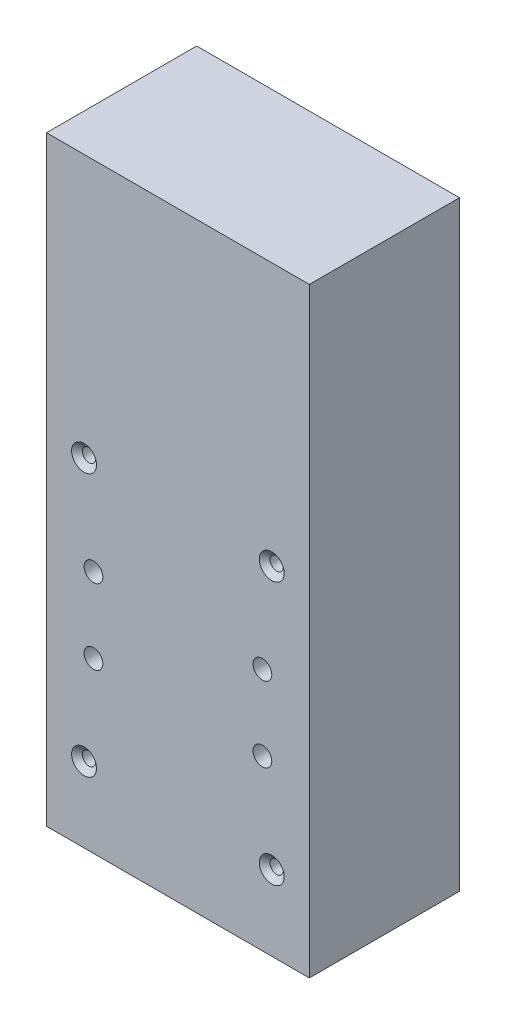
ISO-10303-21;
HEADER;
FILE_DESCRIPTION(('STEP AP214'),'2;1');
FILE_NAME('part.step','',(''),(''),'','','');
FILE_SCHEMA(('AUTOMOTIVE_DESIGN { 1 0 10303 214 1 1 1 1 }'));
ENDSEC;
DATA;
#1=APPLICATION_CONTEXT('core data for automotive mechanical design processes');
#2=APPLICATION_PROTOCOL_DEFINITION('international standard','automotive_design',2000,#1);
#3=PRODUCT_CONTEXT('',#1,'mechanical');
#4=PRODUCT('Part','Part','',(#3));
#5=PRODUCT_RELATED_PRODUCT_CATEGORY('part','',(#4));
#6=PRODUCT_DEFINITION_FORMATION('','',#4);
#7=PRODUCT_DEFINITION_CONTEXT('part definition',#1,'design');
#8=PRODUCT_DEFINITION('design','',#6,#7);
#9=PRODUCT_DEFINITION_SHAPE('','',#8);
#10=(LENGTH_UNIT() NAMED_UNIT(*) SI_UNIT(.MILLI.,.METRE.));
#11=(NAMED_UNIT(*) PLANE_ANGLE_UNIT() SI_UNIT($,.RADIAN.));
#12=(NAMED_UNIT(*) SI_UNIT($,.STERADIAN.) SOLID_ANGLE_UNIT());
#13=UNCERTAINTY_MEASURE_WITH_UNIT(LENGTH_MEASURE(1.E-05),#10,'distance_accuracy_value','');
#14=(GEOMETRIC_REPRESENTATION_CONTEXT(3) GLOBAL_UNCERTAINTY_ASSIGNED_CONTEXT((#13)) GLOBAL_UNIT_ASSIGNED_CONTEXT((#10,
#11,#12)) REPRESENTATION_CONTEXT('',''));
#15=CARTESIAN_POINT('',(0.,0.,0.));
#16=DIRECTION('',(0.,0.,1.));
#17=DIRECTION('',(1.,0.,0.));
#18=AXIS2_PLACEMENT_3D('',#15,#16,#17);
#19=CARTESIAN_POINT('',(-44.45,203.2,-25.4));
#20=DIRECTION('',(0.,0.,1.));
#21=DIRECTION('',(1.,0.,0.));
#22=AXIS2_PLACEMENT_3D('',#19,#20,#21);
#23=PLANE('',#22);
#24=CARTESIAN_POINT('',(28.575,57.1093987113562,-25.4));
#25=DIRECTION('',(0.,0.,1.));
#26=DIRECTION('',(1.,0.,0.));
#27=AXIS2_PLACEMENT_3D('',#24,#25,#26);
#28=CIRCLE('',#27,3.175);
#29=CARTESIAN_POINT('',(31.75,57.1093987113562,-25.4));
#30=VERTEX_POINT('',#29);
#31=EDGE_CURVE('E167',#30,#30,#28,.T.);
#32=ORIENTED_EDGE('',*,*,#31,.T.);
#33=EDGE_LOOP('',(#32));
#34=FACE_BOUND('',#33,.T.);
#35=CARTESIAN_POINT('',(-28.575,57.1093987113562,-25.4));
#36=DIRECTION('',(0.,0.,-1.));
#37=DIRECTION('',(-1.,0.,0.));
#38=AXIS2_PLACEMENT_3D('',#35,#36,#37);
#39=CIRCLE('',#38,3.175);
#40=CARTESIAN_POINT('',(-31.75,57.1093987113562,-25.4));
#41=VERTEX_POINT('',#40);
#42=EDGE_CURVE('E148',#41,#41,#39,.T.);
#43=ORIENTED_EDGE('',*,*,#42,.F.);
#44=EDGE_LOOP('',(#43));
#45=FACE_BOUND('',#44,.T.);
#46=CARTESIAN_POINT('',(-31.75,25.4,-25.4));
#47=DIRECTION('',(0.,0.,1.));
#48=DIRECTION('',(1.,0.,0.));
#49=AXIS2_PLACEMENT_3D('',#46,#47,#48);
#50=CIRCLE('',#49,2.24789999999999);
#51=CARTESIAN_POINT('',(-29.5021,25.4,-25.4));
#52=VERTEX_POINT('',#51);
#53=EDGE_CURVE('E139',#52,#52,#50,.T.);
#54=ORIENTED_EDGE('',*,*,#53,.T.);
#55=EDGE_LOOP('',(#54));
#56=FACE_BOUND('',#55,.T.);
#57=CARTESIAN_POINT('',(31.75,25.4,-25.4));
#58=DIRECTION('',(0.,0.,1.));
#59=DIRECTION('',(1.,0.,0.));
#60=AXIS2_PLACEMENT_3D('',#57,#58,#59);
#61=CIRCLE('',#60,2.24789999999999);
#62=CARTESIAN_POINT('',(33.9979,25.4,-25.4));
#63=VERTEX_POINT('',#62);
#64=EDGE_CURVE('E130',#63,#63,#61,.T.);
#65=ORIENTED_EDGE('',*,*,#64,.T.);
#66=EDGE_LOOP('',(#65));
#67=FACE_BOUND('',#66,.T.);
#68=CARTESIAN_POINT('',(-31.75,114.3,-25.4));
#69=DIRECTION('',(0.,0.,1.));
#70=DIRECTION('',(1.,0.,0.));
#71=AXIS2_PLACEMENT_3D('',#68,#69,#70);
#72=CIRCLE('',#71,2.24789999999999);
#73=CARTESIAN_POINT('',(-29.5021,114.3,-25.4));
#74=VERTEX_POINT('',#73);
#75=EDGE_CURVE('E121',#74,#74,#72,.T.);
#76=ORIENTED_EDGE('',*,*,#75,.T.);
#77=EDGE_LOOP('',(#76));
#78=FACE_BOUND('',#77,.T.);
#79=CARTESIAN_POINT('',(31.75,114.3,-25.4));
#80=DIRECTION('',(0.,0.,1.));
#81=DIRECTION('',(1.,0.,0.));
#82=AXIS2_PLACEMENT_3D('',#79,#80,#81);
#83=CIRCLE('',#82,2.24789999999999);
#84=CARTESIAN_POINT('',(33.9979,114.3,-25.4));
#85=VERTEX_POINT('',#84);
#86=EDGE_CURVE('E101',#85,#85,#83,.T.);
#87=ORIENTED_EDGE('',*,*,#86,.T.);
#88=EDGE_LOOP('',(#87));
#89=FACE_BOUND('',#88,.T.);
#90=DIRECTION('',(-1.,0.,0.));
#91=VECTOR('',#90,1.);
#92=CARTESIAN_POINT('',(-44.45,0.,-25.4));
#93=LINE('',#92,#91);
#94=CARTESIAN_POINT('',(44.45,0.,-25.4));
#95=VERTEX_POINT('',#94);
#96=CARTESIAN_POINT('',(-44.45,0.,-25.4));
#97=VERTEX_POINT('',#96);
#98=EDGE_CURVE('E90',#95,#97,#93,.T.);
#99=ORIENTED_EDGE('',*,*,#98,.T.);
#100=DIRECTION('',(0.,-1.,0.));
#101=VECTOR('',#100,1.);
#102=CARTESIAN_POINT('',(-44.45,203.2,-25.4));
#103=LINE('',#102,#101);
#104=CARTESIAN_POINT('',(-44.45,203.2,-25.4));
#105=VERTEX_POINT('',#104);
#106=EDGE_CURVE('E43',#105,#97,#103,.T.);
#107=ORIENTED_EDGE('',*,*,#106,.F.);
#108=DIRECTION('',(-1.,0.,0.));
#109=VECTOR('',#108,1.);
#110=CARTESIAN_POINT('',(-44.45,203.2,-25.4));
#111=LINE('',#110,#109);
#112=CARTESIAN_POINT('',(44.45,203.2,-25.4));
#113=VERTEX_POINT('',#112);
#114=EDGE_CURVE('E81',#113,#105,#111,.T.);
#115=ORIENTED_EDGE('',*,*,#114,.F.);
#116=DIRECTION('',(0.,-1.,0.));
#117=VECTOR('',#116,1.);
#118=CARTESIAN_POINT('',(44.45,203.2,-25.4));
#119=LINE('',#118,#117);
#120=EDGE_CURVE('E11',#113,#95,#119,.T.);
#121=ORIENTED_EDGE('',*,*,#120,.T.);
#122=EDGE_LOOP('',(#99,#107,#115,#121));
#123=FACE_BOUND('',#122,.T.);
#124=CARTESIAN_POINT('',(28.575,82.5093987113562,-25.4));
#125=DIRECTION('',(0.,0.,-1.));
#126=DIRECTION('',(-1.,0.,0.));
#127=AXIS2_PLACEMENT_3D('',#124,#125,#126);
#128=CIRCLE('',#127,3.175);
#129=CARTESIAN_POINT('',(25.4,82.5093987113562,-25.4));
#130=VERTEX_POINT('',#129);
#131=EDGE_CURVE('E161',#130,#130,#128,.T.);
#132=ORIENTED_EDGE('',*,*,#131,.F.);
#133=EDGE_LOOP('',(#132));
#134=FACE_BOUND('',#133,.T.);
#135=CARTESIAN_POINT('',(-28.575,82.5093987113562,-25.4));
#136=DIRECTION('',(0.,0.,1.));
#137=DIRECTION('',(1.,0.,0.));
#138=AXIS2_PLACEMENT_3D('',#135,#136,#137);
#139=CIRCLE('',#138,3.175);
#140=CARTESIAN_POINT('',(-25.4,82.5093987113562,-25.4));
#141=VERTEX_POINT('',#140);
#142=EDGE_CURVE('E155',#141,#141,#139,.T.);
#143=ORIENTED_EDGE('',*,*,#142,.T.);
#144=EDGE_LOOP('',(#143));
#145=FACE_BOUND('',#144,.T.);
#146=ADVANCED_FACE('F34',(#34,#45,#56,#67,#78,#89,#123,#134,#145),#23,.F.);
#147=CARTESIAN_POINT('',(-44.45,203.2,25.4));
#148=DIRECTION('',(0.,0.,-1.));
#149=DIRECTION('',(-1.,0.,0.));
#150=AXIS2_PLACEMENT_3D('',#147,#148,#149);
#151=PLANE('',#150);
#152=CARTESIAN_POINT('',(28.575,57.1093987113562,25.4));
#153=DIRECTION('',(0.,0.,1.));
#154=DIRECTION('',(1.,0.,0.));
#155=AXIS2_PLACEMENT_3D('',#152,#153,#154);
#156=CIRCLE('',#155,3.175);
#157=CARTESIAN_POINT('',(31.75,57.1093987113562,25.4));
#158=VERTEX_POINT('',#157);
#159=EDGE_CURVE('E152',#158,#158,#156,.T.);
#160=ORIENTED_EDGE('',*,*,#159,.F.);
#161=EDGE_LOOP('',(#160));
#162=FACE_BOUND('',#161,.T.);
#163=CARTESIAN_POINT('',(-28.575,57.1093987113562,25.4));
#164=DIRECTION('',(0.,0.,-1.));
#165=DIRECTION('',(-1.,0.,0.));
#166=AXIS2_PLACEMENT_3D('',#163,#164,#165);
#167=CIRCLE('',#166,3.175);
#168=CARTESIAN_POINT('',(-31.75,57.1093987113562,25.4));
#169=VERTEX_POINT('',#168);
#170=EDGE_CURVE('E149',#169,#169,#167,.T.);
#171=ORIENTED_EDGE('',*,*,#170,.T.);
#172=EDGE_LOOP('',(#171));
#173=FACE_BOUND('',#172,.T.);
#174=CARTESIAN_POINT('',(-31.75,25.4,25.4));
#175=DIRECTION('',(0.,0.,1.));
#176=DIRECTION('',(1.,0.,0.));
#177=AXIS2_PLACEMENT_3D('',#174,#175,#176);
#178=CIRCLE('',#177,4.2164);
#179=CARTESIAN_POINT('',(-27.5336,25.4,25.4));
#180=VERTEX_POINT('',#179);
#181=EDGE_CURVE('E145',#180,#180,#178,.T.);
#182=ORIENTED_EDGE('',*,*,#181,.F.);
#183=EDGE_LOOP('',(#182));
#184=FACE_BOUND('',#183,.T.);
#185=CARTESIAN_POINT('',(31.75,25.4,25.4));
#186=DIRECTION('',(0.,0.,1.));
#187=DIRECTION('',(1.,0.,0.));
#188=AXIS2_PLACEMENT_3D('',#185,#186,#187);
#189=CIRCLE('',#188,4.2164);
#190=CARTESIAN_POINT('',(35.9664,25.4,25.4));
#191=VERTEX_POINT('',#190);
#192=EDGE_CURVE('E136',#191,#191,#189,.T.);
#193=ORIENTED_EDGE('',*,*,#192,.F.);
#194=EDGE_LOOP('',(#193));
#195=FACE_BOUND('',#194,.T.);
#196=CARTESIAN_POINT('',(-31.75,114.3,25.4));
#197=DIRECTION('',(0.,0.,1.));
#198=DIRECTION('',(1.,0.,0.));
#199=AXIS2_PLACEMENT_3D('',#196,#197,#198);
#200=CIRCLE('',#199,4.2164);
#201=CARTESIAN_POINT('',(-27.5336,114.3,25.4));
#202=VERTEX_POINT('',#201);
#203=EDGE_CURVE('E127',#202,#202,#200,.T.);
#204=ORIENTED_EDGE('',*,*,#203,.F.);
#205=EDGE_LOOP('',(#204));
#206=FACE_BOUND('',#205,.T.);
#207=CARTESIAN_POINT('',(31.75,114.3,25.4));
#208=DIRECTION('',(0.,0.,1.));
#209=DIRECTION('',(1.,0.,0.));
#210=AXIS2_PLACEMENT_3D('',#207,#208,#209);
#211=CIRCLE('',#210,4.2164);
#212=CARTESIAN_POINT('',(35.9664,114.3,25.4));
#213=VERTEX_POINT('',#212);
#214=EDGE_CURVE('E118',#213,#213,#211,.T.);
#215=ORIENTED_EDGE('',*,*,#214,.F.);
#216=EDGE_LOOP('',(#215));
#217=FACE_BOUND('',#216,.T.);
#218=DIRECTION('',(1.,0.,0.));
#219=VECTOR('',#218,1.);
#220=CARTESIAN_POINT('',(-44.45,0.,25.4));
#221=LINE('',#220,#219);
#222=CARTESIAN_POINT('',(-44.45,0.,25.4));
#223=VERTEX_POINT('',#222);
#224=CARTESIAN_POINT('',(44.45,0.,25.4));
#225=VERTEX_POINT('',#224);
#226=EDGE_CURVE('E74',#223,#225,#221,.T.);
#227=ORIENTED_EDGE('',*,*,#226,.T.);
#228=DIRECTION('',(0.,-1.,0.));
#229=VECTOR('',#228,1.);
#230=CARTESIAN_POINT('',(44.45,203.2,25.4));
#231=LINE('',#230,#229);
#232=CARTESIAN_POINT('',(44.45,203.2,25.4));
#233=VERTEX_POINT('',#232);
#234=EDGE_CURVE('E94',#233,#225,#231,.T.);
#235=ORIENTED_EDGE('',*,*,#234,.F.);
#236=DIRECTION('',(1.,0.,0.));
#237=VECTOR('',#236,1.);
#238=CARTESIAN_POINT('',(-44.45,203.2,25.4));
#239=LINE('',#238,#237);
#240=CARTESIAN_POINT('',(-44.45,203.2,25.4));
#241=VERTEX_POINT('',#240);
#242=EDGE_CURVE('E51',#241,#233,#239,.T.);
#243=ORIENTED_EDGE('',*,*,#242,.F.);
#244=DIRECTION('',(0.,-1.,0.));
#245=VECTOR('',#244,1.);
#246=CARTESIAN_POINT('',(-44.45,203.2,25.4));
#247=LINE('',#246,#245);
#248=EDGE_CURVE('E91',#241,#223,#247,.T.);
#249=ORIENTED_EDGE('',*,*,#248,.T.);
#250=EDGE_LOOP('',(#227,#235,#243,#249));
#251=FACE_BOUND('',#250,.T.);
#252=CARTESIAN_POINT('',(28.575,82.5093987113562,25.4));
#253=DIRECTION('',(0.,0.,-1.));
#254=DIRECTION('',(-1.,0.,0.));
#255=AXIS2_PLACEMENT_3D('',#252,#253,#254);
#256=CIRCLE('',#255,3.175);
#257=CARTESIAN_POINT('',(25.4,82.5093987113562,25.4));
#258=VERTEX_POINT('',#257);
#259=EDGE_CURVE('E164',#258,#258,#256,.T.);
#260=ORIENTED_EDGE('',*,*,#259,.T.);
#261=EDGE_LOOP('',(#260));
#262=FACE_BOUND('',#261,.T.);
#263=CARTESIAN_POINT('',(-28.575,82.5093987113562,25.4));
#264=DIRECTION('',(0.,0.,1.));
#265=DIRECTION('',(1.,0.,0.));
#266=AXIS2_PLACEMENT_3D('',#263,#264,#265);
#267=CIRCLE('',#266,3.175);
#268=CARTESIAN_POINT('',(-25.4,82.5093987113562,25.4));
#269=VERTEX_POINT('',#268);
#270=EDGE_CURVE('E158',#269,#269,#267,.T.);
#271=ORIENTED_EDGE('',*,*,#270,.F.);
#272=EDGE_LOOP('',(#271));
#273=FACE_BOUND('',#272,.T.);
#274=ADVANCED_FACE('F106',(#162,#173,#184,#195,#206,#217,#251,#262,#273),#151,.F.);
#275=CARTESIAN_POINT('',(44.45,203.2,-25.4));
#276=DIRECTION('',(-1.,0.,0.));
#277=DIRECTION('',(0.,0.,1.));
#278=AXIS2_PLACEMENT_3D('',#275,#276,#277);
#279=PLANE('',#278);
#280=DIRECTION('',(0.,0.,-1.));
#281=VECTOR('',#280,1.);
#282=CARTESIAN_POINT('',(44.45,0.,-25.4));
#283=LINE('',#282,#281);
#284=EDGE_CURVE('E98',#225,#95,#283,.T.);
#285=ORIENTED_EDGE('',*,*,#284,.T.);
#286=ORIENTED_EDGE('',*,*,#120,.F.);
#287=DIRECTION('',(0.,0.,-1.));
#288=VECTOR('',#287,1.);
#289=CARTESIAN_POINT('',(44.45,203.2,-25.4));
#290=LINE('',#289,#288);
#291=EDGE_CURVE('E86',#233,#113,#290,.T.);
#292=ORIENTED_EDGE('',*,*,#291,.F.);
#293=ORIENTED_EDGE('',*,*,#234,.T.);
#294=EDGE_LOOP('',(#285,#286,#292,#293));
#295=FACE_BOUND('',#294,.T.);
#296=ADVANCED_FACE('F36',(#295),#279,.F.);
#297=CARTESIAN_POINT('',(-44.45,203.2,-25.4));
#298=DIRECTION('',(1.,0.,0.));
#299=DIRECTION('',(0.,0.,-1.));
#300=AXIS2_PLACEMENT_3D('',#297,#298,#299);
#301=PLANE('',#300);
#302=DIRECTION('',(0.,0.,1.));
#303=VECTOR('',#302,1.);
#304=CARTESIAN_POINT('',(-44.45,0.,-25.4));
#305=LINE('',#304,#303);
#306=EDGE_CURVE('E68',#97,#223,#305,.T.);
#307=ORIENTED_EDGE('',*,*,#306,.T.);
#308=ORIENTED_EDGE('',*,*,#248,.F.);
#309=DIRECTION('',(0.,0.,1.));
#310=VECTOR('',#309,1.);
#311=CARTESIAN_POINT('',(-44.45,203.2,-25.4));
#312=LINE('',#311,#310);
#313=EDGE_CURVE('E84',#105,#241,#312,.T.);
#314=ORIENTED_EDGE('',*,*,#313,.F.);
#315=ORIENTED_EDGE('',*,*,#106,.T.);
#316=EDGE_LOOP('',(#307,#308,#314,#315));
#317=FACE_BOUND('',#316,.T.);
#318=ADVANCED_FACE('F92',(#317),#301,.F.);
#319=CARTESIAN_POINT('',(0.,203.2,0.));
#320=DIRECTION('',(0.,1.,0.));
#321=DIRECTION('',(0.,0.,1.));
#322=AXIS2_PLACEMENT_3D('',#319,#320,#321);
#323=PLANE('',#322);
#324=ORIENTED_EDGE('',*,*,#291,.T.);
#325=ORIENTED_EDGE('',*,*,#114,.T.);
#326=ORIENTED_EDGE('',*,*,#313,.T.);
#327=ORIENTED_EDGE('',*,*,#242,.T.);
#328=EDGE_LOOP('',(#324,#325,#326,#327));
#329=FACE_BOUND('',#328,.T.);
#330=ADVANCED_FACE('F82',(#329),#323,.T.);
#331=CARTESIAN_POINT('',(0.,0.,0.));
#332=DIRECTION('',(0.,1.,0.));
#333=DIRECTION('',(0.,0.,1.));
#334=AXIS2_PLACEMENT_3D('',#331,#332,#333);
#335=PLANE('',#334);
#336=ORIENTED_EDGE('',*,*,#284,.F.);
#337=ORIENTED_EDGE('',*,*,#226,.F.);
#338=ORIENTED_EDGE('',*,*,#306,.F.);
#339=ORIENTED_EDGE('',*,*,#98,.F.);
#340=EDGE_LOOP('',(#336,#337,#338,#339));
#341=FACE_BOUND('',#340,.T.);
#342=ADVANCED_FACE('F110',(#341),#335,.F.);
#343=CARTESIAN_POINT('',(31.75,114.3,25.4));
#344=DIRECTION('',(0.,0.,1.));
#345=DIRECTION('',(1.,0.,0.));
#346=AXIS2_PLACEMENT_3D('',#343,#344,#345);
#347=CYLINDRICAL_SURFACE('',#346,2.24789999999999);
#348=ORIENTED_EDGE('',*,*,#86,.F.);
#349=EDGE_LOOP('',(#348));
#350=FACE_BOUND('',#349,.T.);
#351=CARTESIAN_POINT('',(31.75,114.3,23.7482323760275));
#352=DIRECTION('',(0.,0.,1.));
#353=DIRECTION('',(1.,0.,0.));
#354=AXIS2_PLACEMENT_3D('',#351,#352,#353);
#355=CIRCLE('',#354,2.24789999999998);
#356=CARTESIAN_POINT('',(33.9979,114.3,23.7482323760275));
#357=VERTEX_POINT('',#356);
#358=EDGE_CURVE('E115',#357,#357,#355,.T.);
#359=ORIENTED_EDGE('',*,*,#358,.T.);
#360=EDGE_LOOP('',(#359));
#361=FACE_BOUND('',#360,.T.);
#362=ADVANCED_FACE('F191',(#350,#361),#347,.F.);
#363=CARTESIAN_POINT('',(31.75,114.3,25.4));
#364=DIRECTION('',(0.,0.,1.));
#365=DIRECTION('',(1.,0.,0.));
#366=AXIS2_PLACEMENT_3D('',#363,#364,#365);
#367=CONICAL_SURFACE('',#366,4.2164,0.872664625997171);
#368=ORIENTED_EDGE('',*,*,#358,.F.);
#369=EDGE_LOOP('',(#368));
#370=FACE_BOUND('',#369,.T.);
#371=ORIENTED_EDGE('',*,*,#214,.T.);
#372=EDGE_LOOP('',(#371));
#373=FACE_BOUND('',#372,.T.);
#374=ADVANCED_FACE('F188',(#370,#373),#367,.F.);
#375=CARTESIAN_POINT('',(-31.75,114.3,25.4));
#376=DIRECTION('',(0.,0.,1.));
#377=DIRECTION('',(1.,0.,0.));
#378=AXIS2_PLACEMENT_3D('',#375,#376,#377);
#379=CYLINDRICAL_SURFACE('',#378,2.24789999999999);
#380=ORIENTED_EDGE('',*,*,#75,.F.);
#381=EDGE_LOOP('',(#380));
#382=FACE_BOUND('',#381,.T.);
#383=CARTESIAN_POINT('',(-31.75,114.3,23.7482323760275));
#384=DIRECTION('',(0.,0.,1.));
#385=DIRECTION('',(1.,0.,0.));
#386=AXIS2_PLACEMENT_3D('',#383,#384,#385);
#387=CIRCLE('',#386,2.24789999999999);
#388=CARTESIAN_POINT('',(-29.5021,114.3,23.7482323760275));
#389=VERTEX_POINT('',#388);
#390=EDGE_CURVE('E124',#389,#389,#387,.T.);
#391=ORIENTED_EDGE('',*,*,#390,.T.);
#392=EDGE_LOOP('',(#391));
#393=FACE_BOUND('',#392,.T.);
#394=ADVANCED_FACE('F190',(#382,#393),#379,.F.);
#395=CARTESIAN_POINT('',(-31.75,114.3,25.4));
#396=DIRECTION('',(0.,0.,1.));
#397=DIRECTION('',(1.,0.,0.));
#398=AXIS2_PLACEMENT_3D('',#395,#396,#397);
#399=CONICAL_SURFACE('',#398,4.2164,0.872664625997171);
#400=ORIENTED_EDGE('',*,*,#390,.F.);
#401=EDGE_LOOP('',(#400));
#402=FACE_BOUND('',#401,.T.);
#403=ORIENTED_EDGE('',*,*,#203,.T.);
#404=EDGE_LOOP('',(#403));
#405=FACE_BOUND('',#404,.T.);
#406=ADVANCED_FACE('F198',(#402,#405),#399,.F.);
#407=CARTESIAN_POINT('',(31.75,25.4,25.4));
#408=DIRECTION('',(0.,0.,1.));
#409=DIRECTION('',(1.,0.,0.));
#410=AXIS2_PLACEMENT_3D('',#407,#408,#409);
#411=CYLINDRICAL_SURFACE('',#410,2.24789999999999);
#412=ORIENTED_EDGE('',*,*,#64,.F.);
#413=EDGE_LOOP('',(#412));
#414=FACE_BOUND('',#413,.T.);
#415=CARTESIAN_POINT('',(31.75,25.4,23.7482323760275));
#416=DIRECTION('',(0.,0.,1.));
#417=DIRECTION('',(1.,0.,0.));
#418=AXIS2_PLACEMENT_3D('',#415,#416,#417);
#419=CIRCLE('',#418,2.24789999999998);
#420=CARTESIAN_POINT('',(33.9979,25.4,23.7482323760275));
#421=VERTEX_POINT('',#420);
#422=EDGE_CURVE('E133',#421,#421,#419,.T.);
#423=ORIENTED_EDGE('',*,*,#422,.T.);
#424=EDGE_LOOP('',(#423));
#425=FACE_BOUND('',#424,.T.);
#426=ADVANCED_FACE('F247',(#414,#425),#411,.F.);
#427=CARTESIAN_POINT('',(31.75,25.4,25.4));
#428=DIRECTION('',(0.,0.,1.));
#429=DIRECTION('',(1.,0.,0.));
#430=AXIS2_PLACEMENT_3D('',#427,#428,#429);
#431=CONICAL_SURFACE('',#430,4.2164,0.872664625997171);
#432=ORIENTED_EDGE('',*,*,#422,.F.);
#433=EDGE_LOOP('',(#432));
#434=FACE_BOUND('',#433,.T.);
#435=ORIENTED_EDGE('',*,*,#192,.T.);
#436=EDGE_LOOP('',(#435));
#437=FACE_BOUND('',#436,.T.);
#438=ADVANCED_FACE('F257',(#434,#437),#431,.F.);
#439=CARTESIAN_POINT('',(-31.75,25.4,25.4));
#440=DIRECTION('',(0.,0.,1.));
#441=DIRECTION('',(1.,0.,0.));
#442=AXIS2_PLACEMENT_3D('',#439,#440,#441);
#443=CYLINDRICAL_SURFACE('',#442,2.24789999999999);
#444=ORIENTED_EDGE('',*,*,#53,.F.);
#445=EDGE_LOOP('',(#444));
#446=FACE_BOUND('',#445,.T.);
#447=CARTESIAN_POINT('',(-31.75,25.4,23.7482323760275));
#448=DIRECTION('',(0.,0.,1.));
#449=DIRECTION('',(1.,0.,0.));
#450=AXIS2_PLACEMENT_3D('',#447,#448,#449);
#451=CIRCLE('',#450,2.24789999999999);
#452=CARTESIAN_POINT('',(-29.5021,25.4,23.7482323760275));
#453=VERTEX_POINT('',#452);
#454=EDGE_CURVE('E142',#453,#453,#451,.T.);
#455=ORIENTED_EDGE('',*,*,#454,.T.);
#456=EDGE_LOOP('',(#455));
#457=FACE_BOUND('',#456,.T.);
#458=ADVANCED_FACE('F267',(#446,#457),#443,.F.);
#459=CARTESIAN_POINT('',(-31.75,25.4,25.4));
#460=DIRECTION('',(0.,0.,1.));
#461=DIRECTION('',(1.,0.,0.));
#462=AXIS2_PLACEMENT_3D('',#459,#460,#461);
#463=CONICAL_SURFACE('',#462,4.2164,0.872664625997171);
#464=ORIENTED_EDGE('',*,*,#454,.F.);
#465=EDGE_LOOP('',(#464));
#466=FACE_BOUND('',#465,.T.);
#467=ORIENTED_EDGE('',*,*,#181,.T.);
#468=EDGE_LOOP('',(#467));
#469=FACE_BOUND('',#468,.T.);
#470=ADVANCED_FACE('F277',(#466,#469),#463,.F.);
#471=CARTESIAN_POINT('',(-28.575,57.1093987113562,-25.4));
#472=DIRECTION('',(0.,0.,1.));
#473=DIRECTION('',(1.,0.,0.));
#474=AXIS2_PLACEMENT_3D('',#471,#472,#473);
#475=CYLINDRICAL_SURFACE('',#474,3.175);
#476=ORIENTED_EDGE('',*,*,#42,.T.);
#477=EDGE_LOOP('',(#476));
#478=FACE_BOUND('',#477,.T.);
#479=ORIENTED_EDGE('',*,*,#170,.F.);
#480=EDGE_LOOP('',(#479));
#481=FACE_BOUND('',#480,.T.);
#482=ADVANCED_FACE('F286',(#478,#481),#475,.F.);
#483=CARTESIAN_POINT('',(28.575,57.1093987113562,-25.4));
#484=DIRECTION('',(0.,0.,1.));
#485=DIRECTION('',(1.,0.,0.));
#486=AXIS2_PLACEMENT_3D('',#483,#484,#485);
#487=CYLINDRICAL_SURFACE('',#486,3.175);
#488=ORIENTED_EDGE('',*,*,#31,.F.);
#489=EDGE_LOOP('',(#488));
#490=FACE_BOUND('',#489,.T.);
#491=ORIENTED_EDGE('',*,*,#159,.T.);
#492=EDGE_LOOP('',(#491));
#493=FACE_BOUND('',#492,.T.);
#494=ADVANCED_FACE('F173',(#490,#493),#487,.F.);
#495=CARTESIAN_POINT('',(28.575,82.5093987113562,-25.4));
#496=DIRECTION('',(0.,0.,1.));
#497=DIRECTION('',(1.,0.,0.));
#498=AXIS2_PLACEMENT_3D('',#495,#496,#497);
#499=CYLINDRICAL_SURFACE('',#498,3.175);
#500=ORIENTED_EDGE('',*,*,#131,.T.);
#501=EDGE_LOOP('',(#500));
#502=FACE_BOUND('',#501,.T.);
#503=ORIENTED_EDGE('',*,*,#259,.F.);
#504=EDGE_LOOP('',(#503));
#505=FACE_BOUND('',#504,.T.);
#506=ADVANCED_FACE('F316',(#502,#505),#499,.F.);
#507=CARTESIAN_POINT('',(-28.575,82.5093987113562,-25.4));
#508=DIRECTION('',(0.,0.,1.));
#509=DIRECTION('',(1.,0.,0.));
#510=AXIS2_PLACEMENT_3D('',#507,#508,#509);
#511=CYLINDRICAL_SURFACE('',#510,3.175);
#512=ORIENTED_EDGE('',*,*,#142,.F.);
#513=EDGE_LOOP('',(#512));
#514=FACE_BOUND('',#513,.T.);
#515=ORIENTED_EDGE('',*,*,#270,.T.);
#516=EDGE_LOOP('',(#515));
#517=FACE_BOUND('',#516,.T.);
#518=ADVANCED_FACE('F326',(#514,#517),#511,.F.);
#519=CLOSED_SHELL('',(#146,#274,#296,#318,#330,#342,#362,#374,#394,#406,#426,#438,#458,#470,
#482,#494,#506,#518));
#520=MANIFOLD_SOLID_BREP('B2',#519);
#521=ADVANCED_BREP_SHAPE_REPRESENTATION('',(#18,#520),#14);
#522=SHAPE_DEFINITION_REPRESENTATION(#9,#521);
ENDSEC;
END-ISO-10303-21;
